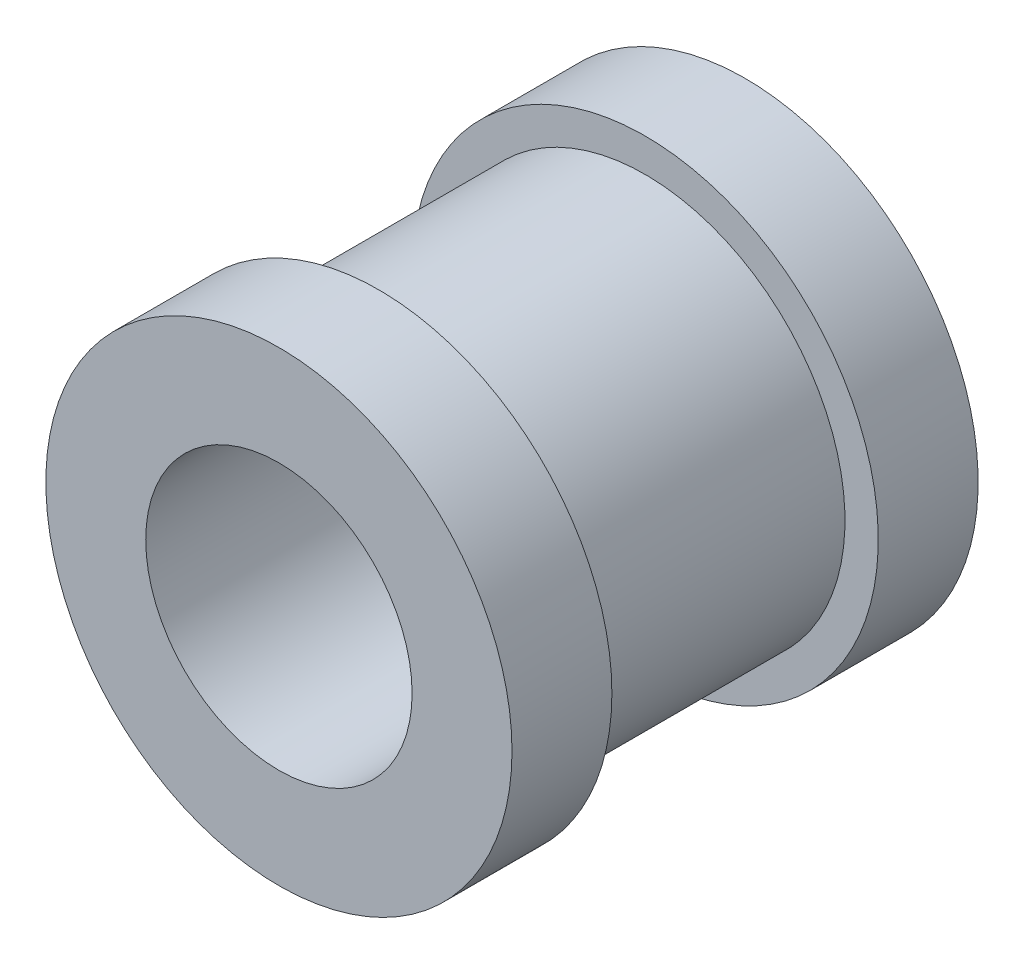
ISO-10303-21;
HEADER;
FILE_DESCRIPTION(('STEP AP214'),'2;1');
FILE_NAME('part.step','',(''),(''),'','','');
FILE_SCHEMA(('AUTOMOTIVE_DESIGN { 1 0 10303 214 1 1 1 1 }'));
ENDSEC;
DATA;
#1=APPLICATION_CONTEXT('core data for automotive mechanical design processes');
#2=APPLICATION_PROTOCOL_DEFINITION('international standard','automotive_design',2000,#1);
#3=PRODUCT_CONTEXT('',#1,'mechanical');
#4=PRODUCT('Part','Part','',(#3));
#5=PRODUCT_RELATED_PRODUCT_CATEGORY('part','',(#4));
#6=PRODUCT_DEFINITION_FORMATION('','',#4);
#7=PRODUCT_DEFINITION_CONTEXT('part definition',#1,'design');
#8=PRODUCT_DEFINITION('design','',#6,#7);
#9=PRODUCT_DEFINITION_SHAPE('','',#8);
#10=(LENGTH_UNIT() NAMED_UNIT(*) SI_UNIT(.MILLI.,.METRE.));
#11=(NAMED_UNIT(*) PLANE_ANGLE_UNIT() SI_UNIT($,.RADIAN.));
#12=(NAMED_UNIT(*) SI_UNIT($,.STERADIAN.) SOLID_ANGLE_UNIT());
#13=UNCERTAINTY_MEASURE_WITH_UNIT(LENGTH_MEASURE(1.E-05),#10,'distance_accuracy_value','');
#14=(GEOMETRIC_REPRESENTATION_CONTEXT(3) GLOBAL_UNCERTAINTY_ASSIGNED_CONTEXT((#13)) GLOBAL_UNIT_ASSIGNED_CONTEXT((#10,
#11,#12)) REPRESENTATION_CONTEXT('',''));
#15=CARTESIAN_POINT('',(0.,0.,0.));
#16=DIRECTION('',(0.,0.,1.));
#17=DIRECTION('',(1.,0.,0.));
#18=AXIS2_PLACEMENT_3D('',#15,#16,#17);
#19=CARTESIAN_POINT('',(0.,0.,7.));
#20=DIRECTION('',(0.,0.,-1.));
#21=DIRECTION('',(-1.,0.,0.));
#22=AXIS2_PLACEMENT_3D('',#19,#20,#21);
#23=CYLINDRICAL_SURFACE('',#22,6.);
#24=CARTESIAN_POINT('',(0.,0.,-4.));
#25=DIRECTION('',(0.,0.,-1.));
#26=DIRECTION('',(-1.,0.,0.));
#27=AXIS2_PLACEMENT_3D('',#24,#25,#26);
#28=CIRCLE('',#27,6.);
#29=CARTESIAN_POINT('',(-6.,0.,-4.));
#30=VERTEX_POINT('',#29);
#31=EDGE_CURVE('E43',#30,#30,#28,.T.);
#32=ORIENTED_EDGE('',*,*,#31,.F.);
#33=EDGE_LOOP('',(#32));
#34=FACE_BOUND('',#33,.T.);
#35=CARTESIAN_POINT('',(0.,0.,4.));
#36=DIRECTION('',(0.,0.,1.));
#37=DIRECTION('',(1.,0.,0.));
#38=AXIS2_PLACEMENT_3D('',#35,#36,#37);
#39=CIRCLE('',#38,6.);
#40=CARTESIAN_POINT('',(6.,0.,4.));
#41=VERTEX_POINT('',#40);
#42=EDGE_CURVE('E10',#41,#41,#39,.T.);
#43=ORIENTED_EDGE('',*,*,#42,.F.);
#44=EDGE_LOOP('',(#43));
#45=FACE_BOUND('',#44,.T.);
#46=ADVANCED_FACE('F37',(#34,#45),#23,.T.);
#47=CARTESIAN_POINT('',(0.,0.,7.));
#48=DIRECTION('',(0.,0.,1.));
#49=DIRECTION('',(1.,0.,0.));
#50=AXIS2_PLACEMENT_3D('',#47,#48,#49);
#51=PLANE('',#50);
#52=CARTESIAN_POINT('',(0.,0.,7.));
#53=DIRECTION('',(0.,0.,1.));
#54=DIRECTION('',(1.,0.,0.));
#55=AXIS2_PLACEMENT_3D('',#52,#53,#54);
#56=CIRCLE('',#55,4.);
#57=CARTESIAN_POINT('',(4.,0.,7.));
#58=VERTEX_POINT('',#57);
#59=EDGE_CURVE('E47',#58,#58,#56,.T.);
#60=ORIENTED_EDGE('',*,*,#59,.F.);
#61=EDGE_LOOP('',(#60));
#62=FACE_BOUND('',#61,.T.);
#63=CARTESIAN_POINT('',(0.,0.,7.));
#64=DIRECTION('',(0.,0.,1.));
#65=DIRECTION('',(1.,0.,0.));
#66=AXIS2_PLACEMENT_3D('',#63,#64,#65);
#67=CIRCLE('',#66,7.);
#68=CARTESIAN_POINT('',(7.,0.,7.));
#69=VERTEX_POINT('',#68);
#70=EDGE_CURVE('E63',#69,#69,#67,.T.);
#71=ORIENTED_EDGE('',*,*,#70,.T.);
#72=EDGE_LOOP('',(#71));
#73=FACE_BOUND('',#72,.T.);
#74=ADVANCED_FACE('F81',(#62,#73),#51,.T.);
#75=CARTESIAN_POINT('',(0.,0.,-7.));
#76=DIRECTION('',(0.,0.,1.));
#77=DIRECTION('',(1.,0.,0.));
#78=AXIS2_PLACEMENT_3D('',#75,#76,#77);
#79=PLANE('',#78);
#80=CARTESIAN_POINT('',(0.,0.,-7.));
#81=DIRECTION('',(0.,0.,1.));
#82=DIRECTION('',(1.,0.,0.));
#83=AXIS2_PLACEMENT_3D('',#80,#81,#82);
#84=CIRCLE('',#83,4.);
#85=CARTESIAN_POINT('',(4.,0.,-7.));
#86=VERTEX_POINT('',#85);
#87=EDGE_CURVE('E51',#86,#86,#84,.T.);
#88=ORIENTED_EDGE('',*,*,#87,.T.);
#89=EDGE_LOOP('',(#88));
#90=FACE_BOUND('',#89,.T.);
#91=CARTESIAN_POINT('',(0.,0.,-7.));
#92=DIRECTION('',(0.,0.,-1.));
#93=DIRECTION('',(-1.,0.,0.));
#94=AXIS2_PLACEMENT_3D('',#91,#92,#93);
#95=CIRCLE('',#94,7.);
#96=CARTESIAN_POINT('',(-7.,0.,-7.));
#97=VERTEX_POINT('',#96);
#98=EDGE_CURVE('E57',#97,#97,#95,.T.);
#99=ORIENTED_EDGE('',*,*,#98,.T.);
#100=EDGE_LOOP('',(#99));
#101=FACE_BOUND('',#100,.T.);
#102=ADVANCED_FACE('F87',(#90,#101),#79,.F.);
#103=CARTESIAN_POINT('',(0.,0.,7.));
#104=DIRECTION('',(0.,0.,-1.));
#105=DIRECTION('',(-1.,0.,0.));
#106=AXIS2_PLACEMENT_3D('',#103,#104,#105);
#107=CYLINDRICAL_SURFACE('',#106,4.);
#108=ORIENTED_EDGE('',*,*,#59,.T.);
#109=EDGE_LOOP('',(#108));
#110=FACE_BOUND('',#109,.T.);
#111=ORIENTED_EDGE('',*,*,#87,.F.);
#112=EDGE_LOOP('',(#111));
#113=FACE_BOUND('',#112,.T.);
#114=ADVANCED_FACE('F94',(#110,#113),#107,.F.);
#115=CARTESIAN_POINT('',(0.,0.,-4.));
#116=DIRECTION('',(0.,0.,-1.));
#117=DIRECTION('',(-1.,0.,0.));
#118=AXIS2_PLACEMENT_3D('',#115,#116,#117);
#119=CYLINDRICAL_SURFACE('',#118,7.);
#120=CARTESIAN_POINT('',(0.,0.,-4.));
#121=DIRECTION('',(0.,0.,-1.));
#122=DIRECTION('',(-1.,0.,0.));
#123=AXIS2_PLACEMENT_3D('',#120,#121,#122);
#124=CIRCLE('',#123,7.);
#125=CARTESIAN_POINT('',(-7.,0.,-4.));
#126=VERTEX_POINT('',#125);
#127=EDGE_CURVE('E55',#126,#126,#124,.T.);
#128=ORIENTED_EDGE('',*,*,#127,.T.);
#129=EDGE_LOOP('',(#128));
#130=FACE_BOUND('',#129,.T.);
#131=ORIENTED_EDGE('',*,*,#98,.F.);
#132=EDGE_LOOP('',(#131));
#133=FACE_BOUND('',#132,.T.);
#134=ADVANCED_FACE('F101',(#130,#133),#119,.T.);
#135=CARTESIAN_POINT('',(0.,0.,-4.));
#136=DIRECTION('',(0.,0.,-1.));
#137=DIRECTION('',(-1.,0.,0.));
#138=AXIS2_PLACEMENT_3D('',#135,#136,#137);
#139=PLANE('',#138);
#140=ORIENTED_EDGE('',*,*,#31,.T.);
#141=EDGE_LOOP('',(#140));
#142=FACE_BOUND('',#141,.T.);
#143=ORIENTED_EDGE('',*,*,#127,.F.);
#144=EDGE_LOOP('',(#143));
#145=FACE_BOUND('',#144,.T.);
#146=ADVANCED_FACE('F78',(#142,#145),#139,.F.);
#147=CARTESIAN_POINT('',(0.,0.,4.));
#148=DIRECTION('',(0.,0.,1.));
#149=DIRECTION('',(1.,0.,0.));
#150=AXIS2_PLACEMENT_3D('',#147,#148,#149);
#151=CYLINDRICAL_SURFACE('',#150,7.);
#152=CARTESIAN_POINT('',(0.,0.,4.));
#153=DIRECTION('',(0.,0.,1.));
#154=DIRECTION('',(1.,0.,0.));
#155=AXIS2_PLACEMENT_3D('',#152,#153,#154);
#156=CIRCLE('',#155,7.);
#157=CARTESIAN_POINT('',(7.,0.,4.));
#158=VERTEX_POINT('',#157);
#159=EDGE_CURVE('E60',#158,#158,#156,.T.);
#160=ORIENTED_EDGE('',*,*,#159,.T.);
#161=EDGE_LOOP('',(#160));
#162=FACE_BOUND('',#161,.T.);
#163=ORIENTED_EDGE('',*,*,#70,.F.);
#164=EDGE_LOOP('',(#163));
#165=FACE_BOUND('',#164,.T.);
#166=ADVANCED_FACE('F69',(#162,#165),#151,.T.);
#167=CARTESIAN_POINT('',(0.,0.,4.));
#168=DIRECTION('',(0.,0.,1.));
#169=DIRECTION('',(1.,0.,0.));
#170=AXIS2_PLACEMENT_3D('',#167,#168,#169);
#171=PLANE('',#170);
#172=ORIENTED_EDGE('',*,*,#42,.T.);
#173=EDGE_LOOP('',(#172));
#174=FACE_BOUND('',#173,.T.);
#175=ORIENTED_EDGE('',*,*,#159,.F.);
#176=EDGE_LOOP('',(#175));
#177=FACE_BOUND('',#176,.T.);
#178=ADVANCED_FACE('F72',(#174,#177),#171,.F.);
#179=CLOSED_SHELL('',(#46,#74,#102,#114,#134,#146,#166,#178));
#180=MANIFOLD_SOLID_BREP('B2',#179);
#181=ADVANCED_BREP_SHAPE_REPRESENTATION('',(#18,#180),#14);
#182=SHAPE_DEFINITION_REPRESENTATION(#9,#181);
ENDSEC;
END-ISO-10303-21;
